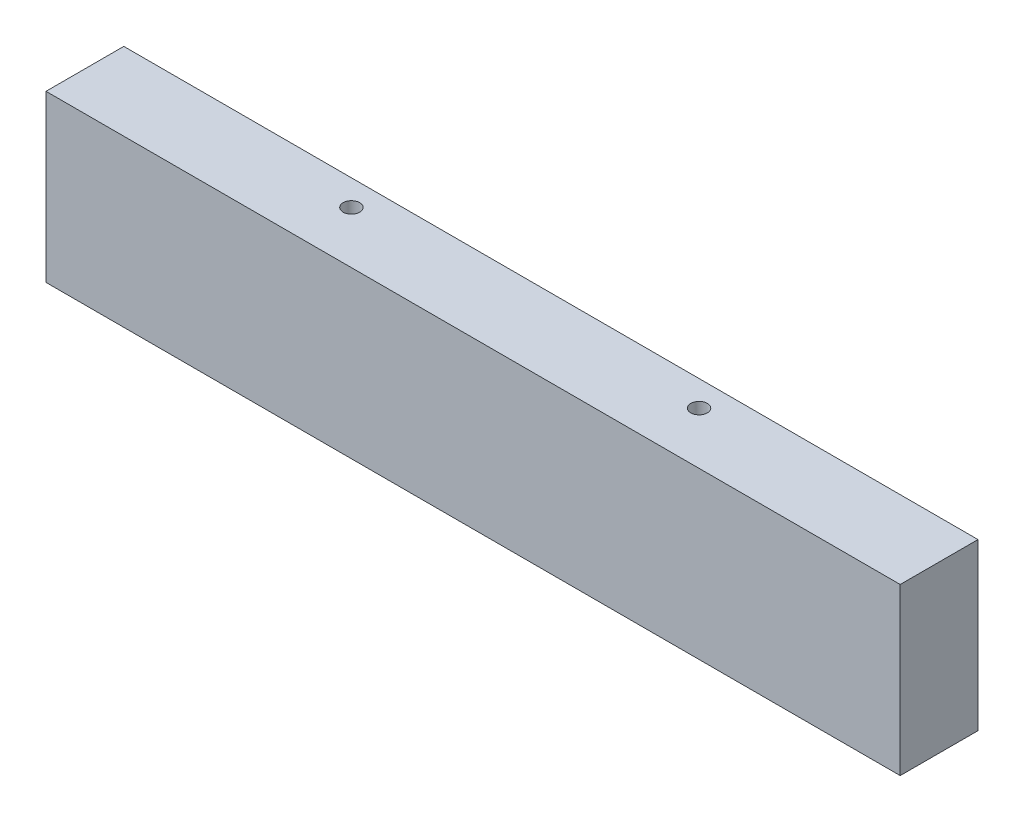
ISO-10303-21;
HEADER;
FILE_DESCRIPTION(('STEP AP214'),'2;1');
FILE_NAME('part.step','',(''),(''),'','','');
FILE_SCHEMA(('AUTOMOTIVE_DESIGN { 1 0 10303 214 1 1 1 1 }'));
ENDSEC;
DATA;
#1=APPLICATION_CONTEXT('core data for automotive mechanical design processes');
#2=APPLICATION_PROTOCOL_DEFINITION('international standard','automotive_design',2000,#1);
#3=PRODUCT_CONTEXT('',#1,'mechanical');
#4=PRODUCT('Part','Part','',(#3));
#5=PRODUCT_RELATED_PRODUCT_CATEGORY('part','',(#4));
#6=PRODUCT_DEFINITION_FORMATION('','',#4);
#7=PRODUCT_DEFINITION_CONTEXT('part definition',#1,'design');
#8=PRODUCT_DEFINITION('design','',#6,#7);
#9=PRODUCT_DEFINITION_SHAPE('','',#8);
#10=(LENGTH_UNIT() NAMED_UNIT(*) SI_UNIT(.MILLI.,.METRE.));
#11=(NAMED_UNIT(*) PLANE_ANGLE_UNIT() SI_UNIT($,.RADIAN.));
#12=(NAMED_UNIT(*) SI_UNIT($,.STERADIAN.) SOLID_ANGLE_UNIT());
#13=UNCERTAINTY_MEASURE_WITH_UNIT(LENGTH_MEASURE(1.E-05),#10,'distance_accuracy_value','');
#14=(GEOMETRIC_REPRESENTATION_CONTEXT(3) GLOBAL_UNCERTAINTY_ASSIGNED_CONTEXT((#13)) GLOBAL_UNIT_ASSIGNED_CONTEXT((#10,
#11,#12)) REPRESENTATION_CONTEXT('',''));
#15=CARTESIAN_POINT('',(0.,0.,0.));
#16=DIRECTION('',(0.,0.,1.));
#17=DIRECTION('',(1.,0.,0.));
#18=AXIS2_PLACEMENT_3D('',#15,#16,#17);
#19=CARTESIAN_POINT('',(0.,100.,0.));
#20=DIRECTION('',(1.,0.,0.));
#21=DIRECTION('',(0.,0.,-1.));
#22=AXIS2_PLACEMENT_3D('',#19,#20,#21);
#23=PLANE('',#22);
#24=DIRECTION('',(0.,0.,1.));
#25=VECTOR('',#24,1.);
#26=CARTESIAN_POINT('',(0.,0.,0.));
#27=LINE('',#26,#25);
#28=CARTESIAN_POINT('',(0.,0.,-47.));
#29=VERTEX_POINT('',#28);
#30=CARTESIAN_POINT('',(0.,0.,0.));
#31=VERTEX_POINT('',#30);
#32=EDGE_CURVE('E96',#29,#31,#27,.T.);
#33=ORIENTED_EDGE('',*,*,#32,.T.);
#34=DIRECTION('',(0.,-1.,0.));
#35=VECTOR('',#34,1.);
#36=CARTESIAN_POINT('',(0.,100.,0.));
#37=LINE('',#36,#35);
#38=CARTESIAN_POINT('',(0.,100.,0.));
#39=VERTEX_POINT('',#38);
#40=EDGE_CURVE('E11',#39,#31,#37,.T.);
#41=ORIENTED_EDGE('',*,*,#40,.F.);
#42=DIRECTION('',(0.,0.,1.));
#43=VECTOR('',#42,1.);
#44=CARTESIAN_POINT('',(0.,100.,0.));
#45=LINE('',#44,#43);
#46=CARTESIAN_POINT('',(0.,100.,-47.));
#47=VERTEX_POINT('',#46);
#48=EDGE_CURVE('E84',#47,#39,#45,.T.);
#49=ORIENTED_EDGE('',*,*,#48,.F.);
#50=DIRECTION('',(0.,-1.,0.));
#51=VECTOR('',#50,1.);
#52=CARTESIAN_POINT('',(0.,100.,-47.));
#53=LINE('',#52,#51);
#54=EDGE_CURVE('E92',#47,#29,#53,.T.);
#55=ORIENTED_EDGE('',*,*,#54,.T.);
#56=EDGE_LOOP('',(#33,#41,#49,#55));
#57=FACE_BOUND('',#56,.T.);
#58=ADVANCED_FACE('F33',(#57),#23,.F.);
#59=CARTESIAN_POINT('',(0.,100.,0.));
#60=DIRECTION('',(0.,0.,-1.));
#61=DIRECTION('',(-1.,0.,0.));
#62=AXIS2_PLACEMENT_3D('',#59,#60,#61);
#63=PLANE('',#62);
#64=DIRECTION('',(1.,0.,0.));
#65=VECTOR('',#64,1.);
#66=CARTESIAN_POINT('',(0.,0.,0.));
#67=LINE('',#66,#65);
#68=CARTESIAN_POINT('',(516.,0.,0.));
#69=VERTEX_POINT('',#68);
#70=EDGE_CURVE('E88',#31,#69,#67,.T.);
#71=ORIENTED_EDGE('',*,*,#70,.T.);
#72=DIRECTION('',(0.,-1.,0.));
#73=VECTOR('',#72,1.);
#74=CARTESIAN_POINT('',(516.,100.,0.));
#75=LINE('',#74,#73);
#76=CARTESIAN_POINT('',(516.,100.,0.));
#77=VERTEX_POINT('',#76);
#78=EDGE_CURVE('E41',#77,#69,#75,.T.);
#79=ORIENTED_EDGE('',*,*,#78,.F.);
#80=DIRECTION('',(1.,0.,0.));
#81=VECTOR('',#80,1.);
#82=CARTESIAN_POINT('',(0.,100.,0.));
#83=LINE('',#82,#81);
#84=EDGE_CURVE('E79',#39,#77,#83,.T.);
#85=ORIENTED_EDGE('',*,*,#84,.F.);
#86=ORIENTED_EDGE('',*,*,#40,.T.);
#87=EDGE_LOOP('',(#71,#79,#85,#86));
#88=FACE_BOUND('',#87,.T.);
#89=ADVANCED_FACE('F87',(#88),#63,.F.);
#90=CARTESIAN_POINT('',(516.,100.,0.));
#91=DIRECTION('',(-1.,0.,0.));
#92=DIRECTION('',(0.,0.,1.));
#93=AXIS2_PLACEMENT_3D('',#90,#91,#92);
#94=PLANE('',#93);
#95=DIRECTION('',(0.,0.,-1.));
#96=VECTOR('',#95,1.);
#97=CARTESIAN_POINT('',(516.,0.,0.));
#98=LINE('',#97,#96);
#99=CARTESIAN_POINT('',(516.,0.,-47.));
#100=VERTEX_POINT('',#99);
#101=EDGE_CURVE('E66',#69,#100,#98,.T.);
#102=ORIENTED_EDGE('',*,*,#101,.T.);
#103=DIRECTION('',(0.,-1.,0.));
#104=VECTOR('',#103,1.);
#105=CARTESIAN_POINT('',(516.,100.,-47.));
#106=LINE('',#105,#104);
#107=CARTESIAN_POINT('',(516.,100.,-47.));
#108=VERTEX_POINT('',#107);
#109=EDGE_CURVE('E89',#108,#100,#106,.T.);
#110=ORIENTED_EDGE('',*,*,#109,.F.);
#111=DIRECTION('',(0.,0.,-1.));
#112=VECTOR('',#111,1.);
#113=CARTESIAN_POINT('',(516.,100.,0.));
#114=LINE('',#113,#112);
#115=EDGE_CURVE('E82',#77,#108,#114,.T.);
#116=ORIENTED_EDGE('',*,*,#115,.F.);
#117=ORIENTED_EDGE('',*,*,#78,.T.);
#118=EDGE_LOOP('',(#102,#110,#116,#117));
#119=FACE_BOUND('',#118,.T.);
#120=ADVANCED_FACE('F90',(#119),#94,.F.);
#121=CARTESIAN_POINT('',(0.,100.,-47.));
#122=DIRECTION('',(0.,0.,1.));
#123=DIRECTION('',(1.,0.,0.));
#124=AXIS2_PLACEMENT_3D('',#121,#122,#123);
#125=PLANE('',#124);
#126=DIRECTION('',(-1.,0.,0.));
#127=VECTOR('',#126,1.);
#128=CARTESIAN_POINT('',(0.,0.,-47.));
#129=LINE('',#128,#127);
#130=EDGE_CURVE('E72',#100,#29,#129,.T.);
#131=ORIENTED_EDGE('',*,*,#130,.T.);
#132=ORIENTED_EDGE('',*,*,#54,.F.);
#133=DIRECTION('',(-1.,0.,0.));
#134=VECTOR('',#133,1.);
#135=CARTESIAN_POINT('',(0.,100.,-47.));
#136=LINE('',#135,#134);
#137=EDGE_CURVE('E49',#108,#47,#136,.T.);
#138=ORIENTED_EDGE('',*,*,#137,.F.);
#139=ORIENTED_EDGE('',*,*,#109,.T.);
#140=EDGE_LOOP('',(#131,#132,#138,#139));
#141=FACE_BOUND('',#140,.T.);
#142=ADVANCED_FACE('F104',(#141),#125,.F.);
#143=CARTESIAN_POINT('',(0.,100.,0.));
#144=DIRECTION('',(0.,-1.,0.));
#145=DIRECTION('',(0.,0.,-1.));
#146=AXIS2_PLACEMENT_3D('',#143,#144,#145);
#147=PLANE('',#146);
#148=CARTESIAN_POINT('',(153.,100.,-31.5000000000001));
#149=DIRECTION('',(0.,1.,0.));
#150=DIRECTION('',(0.,0.,1.));
#151=AXIS2_PLACEMENT_3D('',#148,#149,#150);
#152=CIRCLE('',#151,4.99999999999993);
#153=CARTESIAN_POINT('',(153.,100.,-26.5000000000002));
#154=VERTEX_POINT('',#153);
#155=EDGE_CURVE('E99',#154,#154,#152,.T.);
#156=ORIENTED_EDGE('',*,*,#155,.F.);
#157=EDGE_LOOP('',(#156));
#158=FACE_BOUND('',#157,.T.);
#159=CARTESIAN_POINT('',(363.,100.,-31.5000000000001));
#160=DIRECTION('',(0.,1.,0.));
#161=DIRECTION('',(0.,0.,1.));
#162=AXIS2_PLACEMENT_3D('',#159,#160,#161);
#163=CIRCLE('',#162,5.00000000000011);
#164=CARTESIAN_POINT('',(363.,100.,-26.5));
#165=VERTEX_POINT('',#164);
#166=EDGE_CURVE('E113',#165,#165,#163,.T.);
#167=ORIENTED_EDGE('',*,*,#166,.F.);
#168=EDGE_LOOP('',(#167));
#169=FACE_BOUND('',#168,.T.);
#170=ORIENTED_EDGE('',*,*,#48,.T.);
#171=ORIENTED_EDGE('',*,*,#84,.T.);
#172=ORIENTED_EDGE('',*,*,#115,.T.);
#173=ORIENTED_EDGE('',*,*,#137,.T.);
#174=EDGE_LOOP('',(#170,#171,#172,#173));
#175=FACE_BOUND('',#174,.T.);
#176=ADVANCED_FACE('F80',(#158,#169,#175),#147,.F.);
#177=CARTESIAN_POINT('',(0.,0.,0.));
#178=DIRECTION('',(0.,-1.,0.));
#179=DIRECTION('',(0.,0.,-1.));
#180=AXIS2_PLACEMENT_3D('',#177,#178,#179);
#181=PLANE('',#180);
#182=CARTESIAN_POINT('',(153.,0.,-31.5000000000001));
#183=DIRECTION('',(0.,-1.,0.));
#184=DIRECTION('',(0.,0.,-1.));
#185=AXIS2_PLACEMENT_3D('',#182,#183,#184);
#186=CIRCLE('',#185,4.99999999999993);
#187=CARTESIAN_POINT('',(153.,0.,-36.5));
#188=VERTEX_POINT('',#187);
#189=EDGE_CURVE('E116',#188,#188,#186,.F.);
#190=ORIENTED_EDGE('',*,*,#189,.T.);
#191=EDGE_LOOP('',(#190));
#192=FACE_BOUND('',#191,.T.);
#193=CARTESIAN_POINT('',(363.,0.,-31.5000000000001));
#194=DIRECTION('',(0.,-1.,0.));
#195=DIRECTION('',(0.,0.,-1.));
#196=AXIS2_PLACEMENT_3D('',#193,#194,#195);
#197=CIRCLE('',#196,5.00000000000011);
#198=CARTESIAN_POINT('',(363.,0.,-36.5000000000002));
#199=VERTEX_POINT('',#198);
#200=EDGE_CURVE('E110',#199,#199,#197,.F.);
#201=ORIENTED_EDGE('',*,*,#200,.T.);
#202=EDGE_LOOP('',(#201));
#203=FACE_BOUND('',#202,.T.);
#204=ORIENTED_EDGE('',*,*,#32,.F.);
#205=ORIENTED_EDGE('',*,*,#130,.F.);
#206=ORIENTED_EDGE('',*,*,#101,.F.);
#207=ORIENTED_EDGE('',*,*,#70,.F.);
#208=EDGE_LOOP('',(#204,#205,#206,#207));
#209=FACE_BOUND('',#208,.T.);
#210=ADVANCED_FACE('F107',(#192,#203,#209),#181,.T.);
#211=CARTESIAN_POINT('',(363.,-0.001000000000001,-31.5000000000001));
#212=DIRECTION('',(0.,1.,0.));
#213=DIRECTION('',(0.,0.,1.));
#214=AXIS2_PLACEMENT_3D('',#211,#212,#213);
#215=CYLINDRICAL_SURFACE('',#214,5.00000000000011);
#216=ORIENTED_EDGE('',*,*,#200,.F.);
#217=EDGE_LOOP('',(#216));
#218=FACE_BOUND('',#217,.T.);
#219=ORIENTED_EDGE('',*,*,#166,.T.);
#220=EDGE_LOOP('',(#219));
#221=FACE_BOUND('',#220,.T.);
#222=ADVANCED_FACE('F129',(#218,#221),#215,.F.);
#223=CARTESIAN_POINT('',(153.,-0.001000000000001,-31.5000000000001));
#224=DIRECTION('',(0.,1.,0.));
#225=DIRECTION('',(0.,0.,1.));
#226=AXIS2_PLACEMENT_3D('',#223,#224,#225);
#227=CYLINDRICAL_SURFACE('',#226,4.99999999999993);
#228=ORIENTED_EDGE('',*,*,#189,.F.);
#229=EDGE_LOOP('',(#228));
#230=FACE_BOUND('',#229,.T.);
#231=ORIENTED_EDGE('',*,*,#155,.T.);
#232=EDGE_LOOP('',(#231));
#233=FACE_BOUND('',#232,.T.);
#234=ADVANCED_FACE('F122',(#230,#233),#227,.F.);
#235=CLOSED_SHELL('',(#58,#89,#120,#142,#176,#210,#222,#234));
#236=MANIFOLD_SOLID_BREP('B2',#235);
#237=ADVANCED_BREP_SHAPE_REPRESENTATION('',(#18,#236),#14);
#238=SHAPE_DEFINITION_REPRESENTATION(#9,#237);
ENDSEC;
END-ISO-10303-21;
